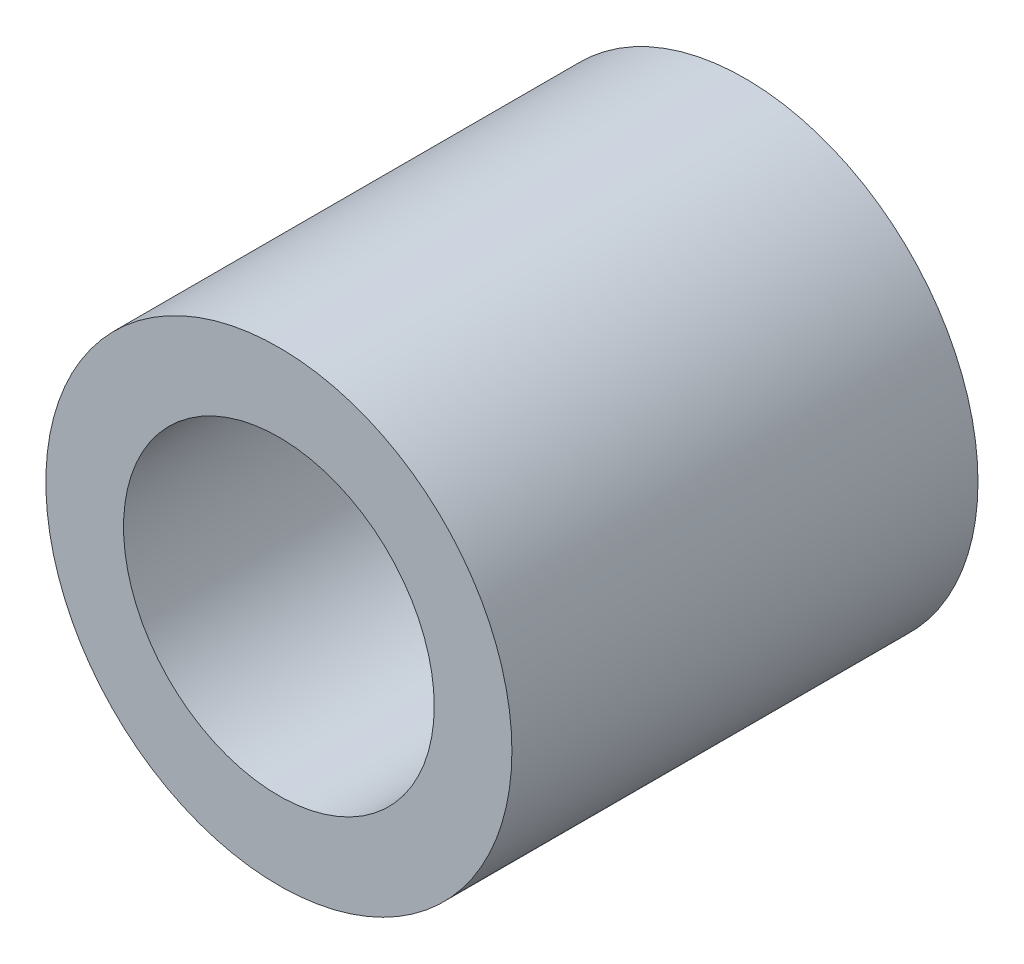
from build123d import *

# Parameters (mm, degrees)
ESQUISSE1_R      = 3
ESQUISSE1_R_2    = 2
EXTRUSION1_DEPTH = 6


with BuildPart() as part:
    # Esquisse1 → Extrusion1 (new body)
    with BuildSketch(Plane.XY):
        Circle(ESQUISSE1_R)
        Circle(ESQUISSE1_R_2, mode=Mode.SUBTRACT)
    extrude(amount=EXTRUSION1_DEPTH)


solid = part.part
